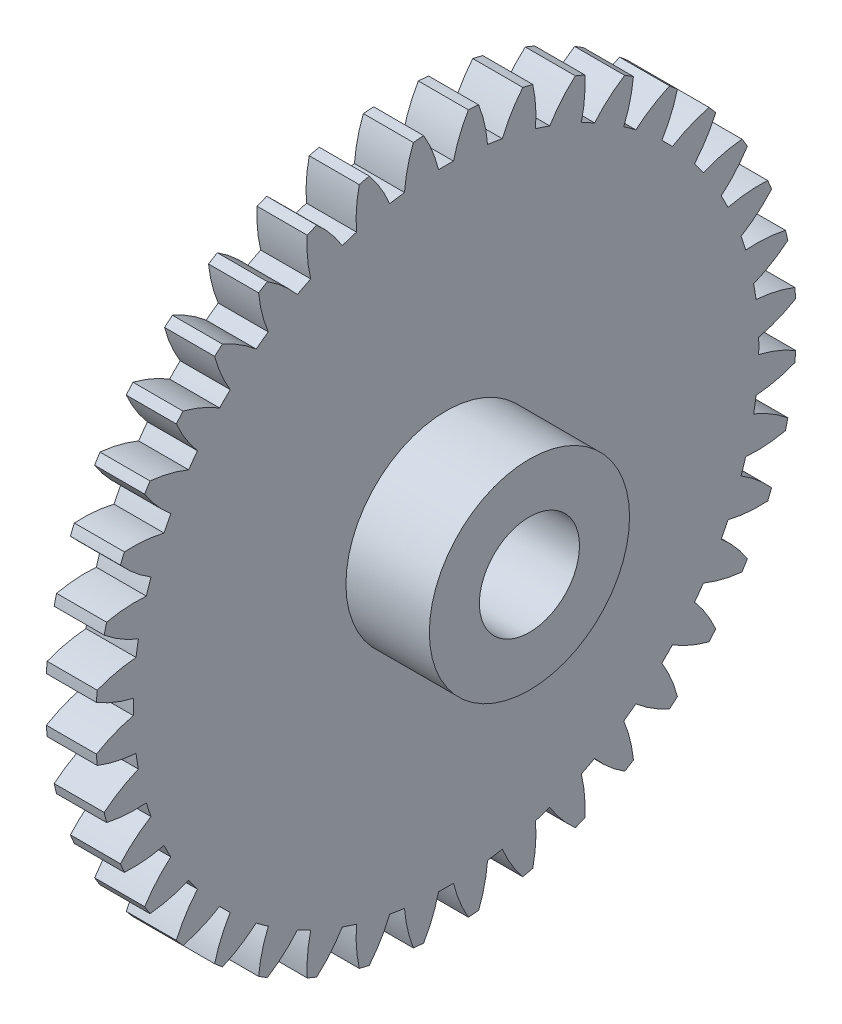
from build123d import *

# Parameters (mm, degrees)
BASPROSKE_W             = 1.5
BASPROSKE_H             = 10.5
TOOTHCUT_DEPTH          = 15.924811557
TEETHCUTS_COUNT         = 40
TEETHCUTS_ANGLE         = 351
EXTRUSION1_DEPTH        = 2.5
EXTRUSION1_DEPTH_BACK   = 2
ESQUISSE1_R             = 3
ESQUISSE2_R             = 1.5
ENL_V_MAT_EXTRU_1_DEPTH = 16.487152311
ESQUISSE4_R             = 1.5
ENL_V_MAT_EXTRU_3_DEPTH = 0.5


with BuildPart() as part:
    # BasProSke → Base-Revolve (revolve)
    with BuildSketch(Plane(origin=(0, 0, 0), x_dir=(1, 0, 0), z_dir=(0, 1, 0)), mode=Mode.PRIVATE) as base_revolve_sk:
        with Locations((0.75, 5.25)):
            Rectangle(BASPROSKE_W, BASPROSKE_H)
    revolve(base_revolve_sk.sketch.rotate(Axis((-10, 0, 0), (1, 0, 0)), 180), axis=Axis((-10, 0, 0), (1, 0, 0)))

    # TooCutSke → ToothCut (cut, through all)
    with BuildSketch(Plane(origin=(0, 0, 0), x_dir=(0, 0, -1), z_dir=(1, 0, 0))):
        with BuildLine():
            ThreePointArc((0.22421855, 9.371318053), (0, 9.374), (-0.22421855, 9.371318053))
            ThreePointArc((-0.22421855, 9.371318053), (-0.410979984, 9.954898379), (-0.684682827, 10.503106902))
            ThreePointArc((-0.684682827, 10.503106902), (0, 10.5254), (0.684682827, 10.503106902))
            ThreePointArc((0.684682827, 10.503106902), (0.410979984, 9.954898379), (0.22421855, 9.371318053))
        make_face()
    toothcut = extrude(amount=TOOTHCUT_DEPTH, mode=Mode.SUBTRACT)

    # TeethCuts: ToothCut ×40 about axis
    teethcuts_axis = Axis((-10, 0, 0), (1, 0, 0))
    for i in range(1, TEETHCUTS_COUNT):
        add(toothcut.rotate(teethcuts_axis, i * TEETHCUTS_ANGLE / (TEETHCUTS_COUNT - 1)), mode=Mode.SUBTRACT)

    # Esquisse1 → Extrusion1 (add, two sides: drawn at the far end of the back side and taken through both)
    with BuildSketch(Plane(origin=(1.5, 0, 0), x_dir=(0, 0, -1), z_dir=(1, 0, 0)).offset(-EXTRUSION1_DEPTH_BACK)):
        Circle(ESQUISSE1_R)
    extrude(amount=EXTRUSION1_DEPTH + EXTRUSION1_DEPTH_BACK)

    # Esquisse2 → Enl_v. mat.-Extru.1 (cut, through all)
    with BuildSketch(Plane(origin=(4, 0, 0), x_dir=(0, 0, -1), z_dir=(1, 0, 0))):
        Circle(ESQUISSE2_R)
    extrude(amount=-ENL_V_MAT_EXTRU_1_DEPTH, mode=Mode.SUBTRACT)

    # Esquisse4 → Enl_v. mat.-Extru.3 (cut)
    with BuildSketch(Plane.ZY):
        with Locations((0, 5.5)):
            Circle(ESQUISSE4_R)
        with Locations((4.763139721, 2.75)):
            Circle(ESQUISSE4_R)
        with Locations((4.763139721, -2.75)):
            Circle(ESQUISSE4_R)
        with Locations((0, -5.5)):
            Circle(ESQUISSE4_R)
        with Locations((-4.763139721, -2.75)):
            Circle(ESQUISSE4_R)
        with Locations((-4.763139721, 2.75)):
            Circle(ESQUISSE4_R)
    extrude(amount=-ENL_V_MAT_EXTRU_3_DEPTH, mode=Mode.SUBTRACT)


solid = part.part
